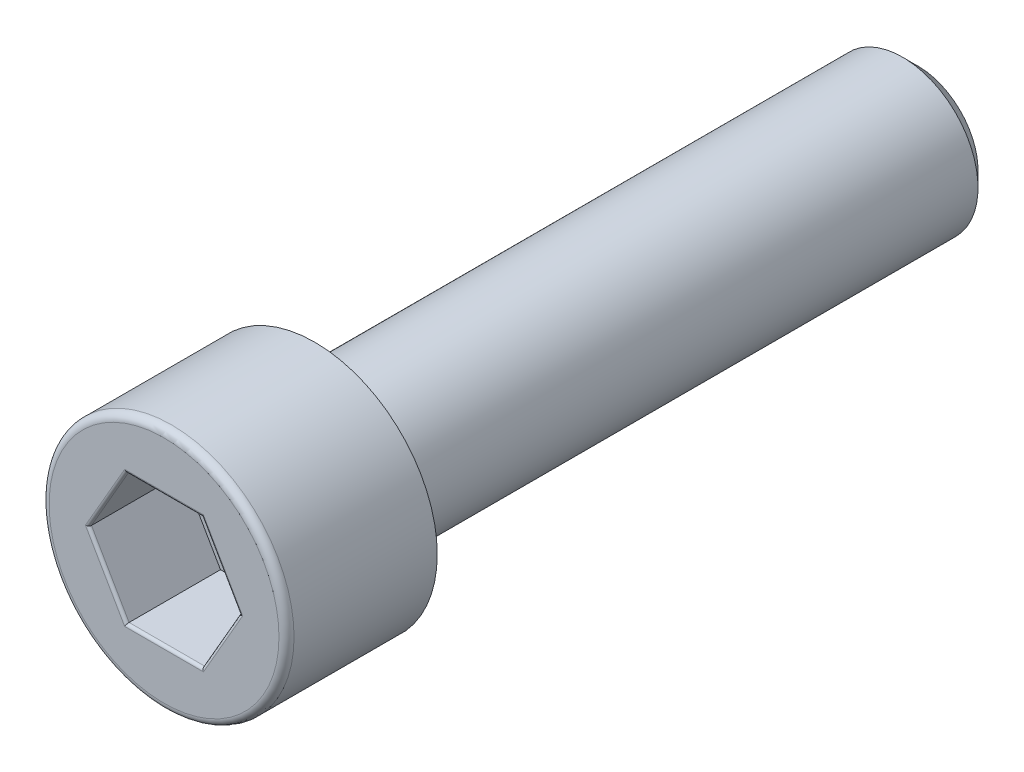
from build123d import *

# Parameters (mm, degrees)
ESQUISSE1_R             = 6.5
BASE_EXTRUSION_DEPTH    = 8
ENL_V_MAT_EXTRU_1_DEPTH = 5
CONG_1_R                = 0.4
CONG_2_R                = 0.15
ESQUISSE3_R             = 4
BOSS_EXTRU_1_DEPTH      = 32
CHANFREIN1_SIZE         = 0.8


with BuildPart() as part:
    # Esquisse1 → Base-Extrusion (new body)
    with BuildSketch(Plane.XY):
        Circle(ESQUISSE1_R)
    extrude(amount=BASE_EXTRUSION_DEPTH)

    # Esquisse2 → Enl_v. mat.-Extru.1 (cut)
    with BuildSketch(Plane.XY.offset(8)):
        Polygon((-4, 0), (-2.004145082, 3.461705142), (2.004145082, 3.461705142), (4, 0), (2.004145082, -3.461705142), (-2.004145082, -3.461705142), align=None)
    extrude(amount=-ENL_V_MAT_EXTRU_1_DEPTH, mode=Mode.SUBTRACT)

    # Cong_1
    cong_1_edges = [part.edges().sort_by_distance(p)[0] for p in [
        (-6.5, 0, 8),
    ]]
    fillet(cong_1_edges, radius=CONG_1_R)

    # Cong_2
    cong_2_edges = [part.edges().sort_by_distance(p)[0] for p in [
        (-3.002072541, -1.730852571, 8),
        (0, -3.461705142, 8),
        (3.002072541, -1.730852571, 8),
        (3.002072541, 1.730852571, 8),
        (0, 3.461705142, 8),
        (-3.002072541, 1.730852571, 8),
    ]]
    fillet(cong_2_edges, radius=CONG_2_R)

    # Esquisse3 → Boss.-Extru.1 (add)
    with BuildSketch(Plane(origin=(0, 0, 0), x_dir=(-1, 0, 0), z_dir=(0, 0, -1))):
        Circle(ESQUISSE3_R)
    extrude(amount=BOSS_EXTRU_1_DEPTH)

    # Chanfrein1
    chanfrein1_edges = [part.edges().sort_by_distance(p)[0] for p in [
        (4, 0, -32),
    ]]
    chamfer(chanfrein1_edges, length=CHANFREIN1_SIZE)


solid = part.part
